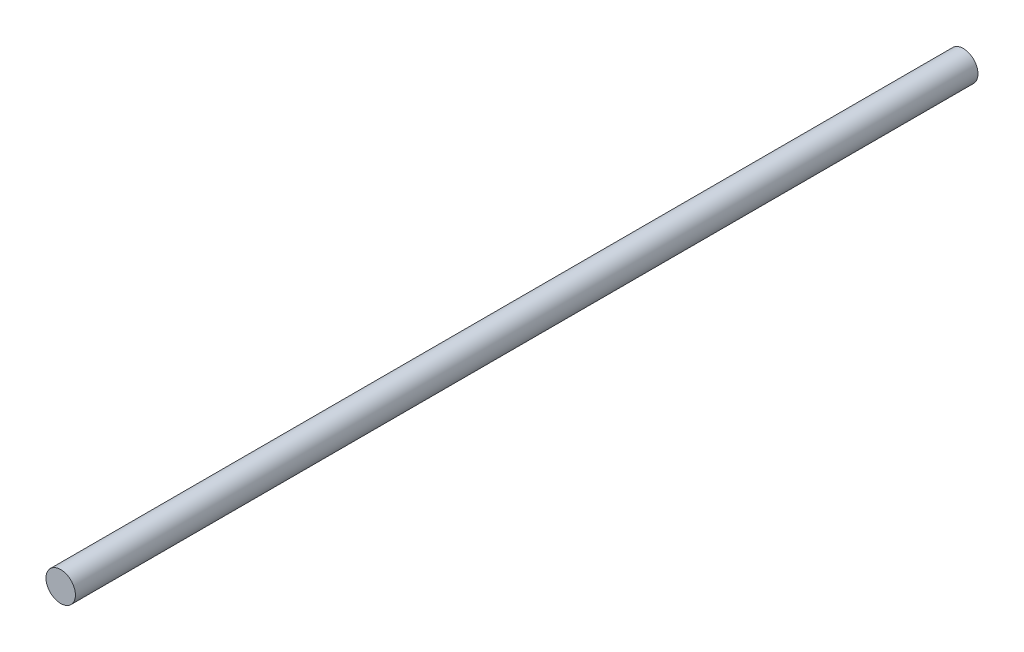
from build123d import *

# Parameters (mm, degrees)
SKETCH1_R           = 2.8
BOSS_EXTRUDE1_DEPTH = 171.73


with BuildPart() as part:
    # Sketch1 → Boss-Extrude1 (new body)
    with BuildSketch(Plane.XY):
        Circle(SKETCH1_R)
    extrude(amount=BOSS_EXTRUDE1_DEPTH)


solid = part.part
